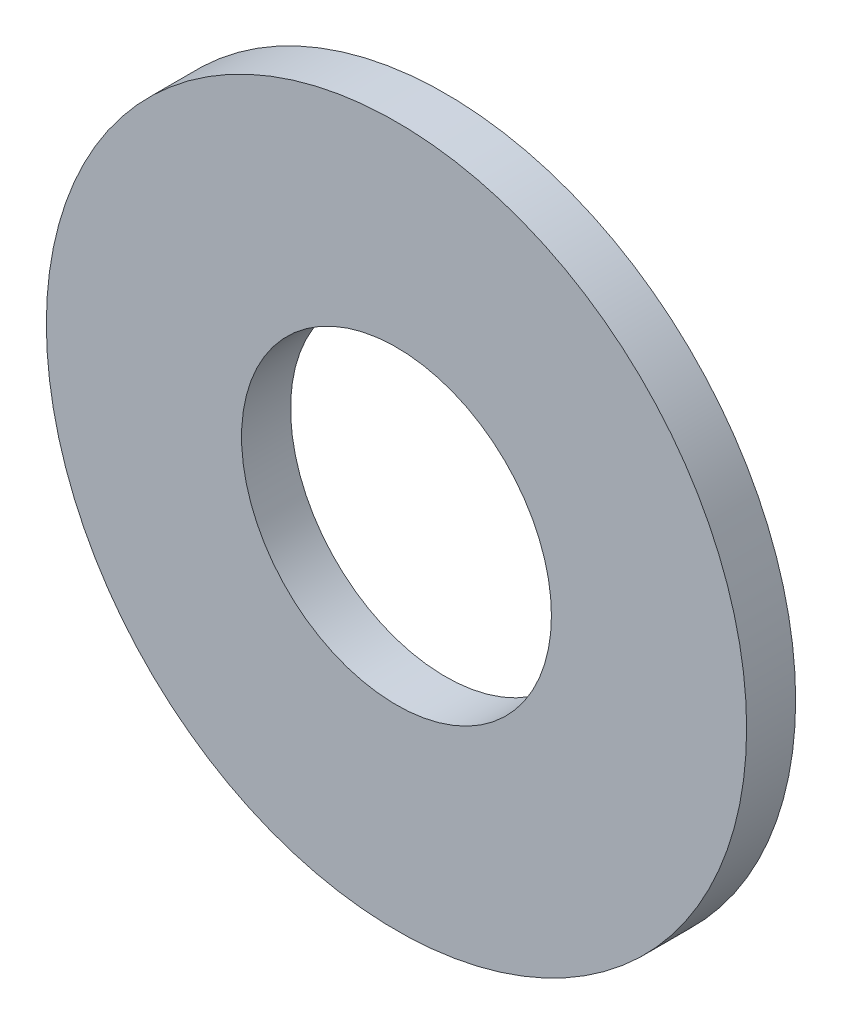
from build123d import *

# Parameters (mm, degrees)
SKETCH1_R           = 12.7
SKETCH1_R_2         = 5.61975
BOSS_EXTRUDE1_DEPTH = 1.778


with BuildPart() as part:
    # Sketch1 → Boss-Extrude1 (new body)
    with BuildSketch(Plane.XY):
        Circle(SKETCH1_R)
        Circle(SKETCH1_R_2, mode=Mode.SUBTRACT)
    extrude(amount=BOSS_EXTRUDE1_DEPTH)


solid = part.part
